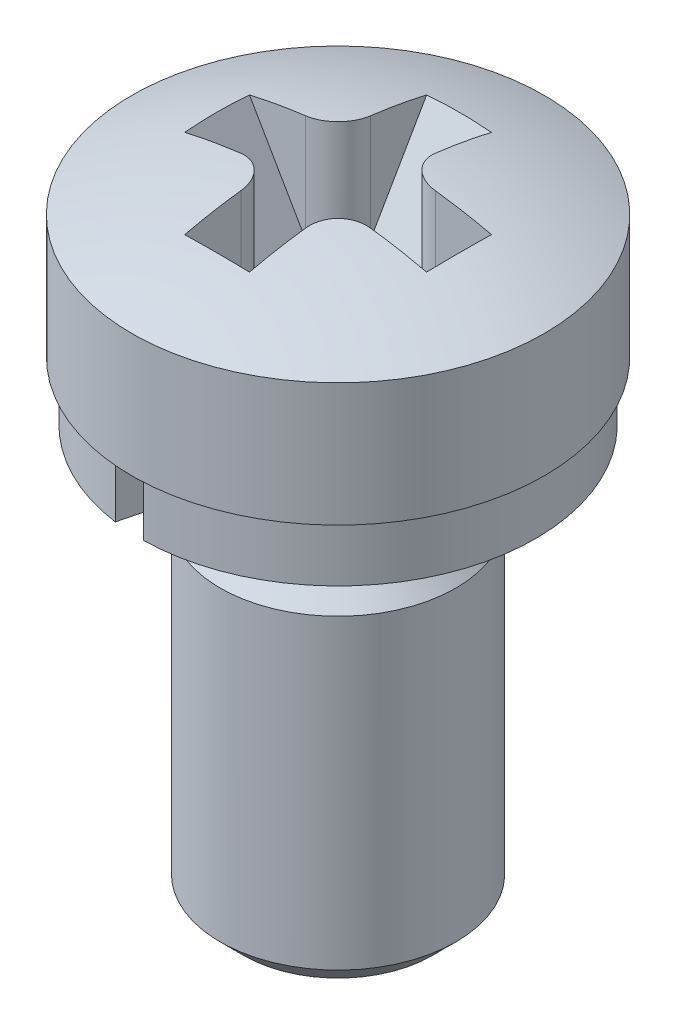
ISO-10303-21;
HEADER;
FILE_DESCRIPTION(('STEP AP214'),'2;1');
FILE_NAME('part.step','',(''),(''),'','','');
FILE_SCHEMA(('AUTOMOTIVE_DESIGN { 1 0 10303 214 1 1 1 1 }'));
ENDSEC;
DATA;
#1=APPLICATION_CONTEXT('core data for automotive mechanical design processes');
#2=APPLICATION_PROTOCOL_DEFINITION('international standard','automotive_design',2000,#1);
#3=PRODUCT_CONTEXT('',#1,'mechanical');
#4=PRODUCT('Part','Part','',(#3));
#5=PRODUCT_RELATED_PRODUCT_CATEGORY('part','',(#4));
#6=PRODUCT_DEFINITION_FORMATION('','',#4);
#7=PRODUCT_DEFINITION_CONTEXT('part definition',#1,'design');
#8=PRODUCT_DEFINITION('design','',#6,#7);
#9=PRODUCT_DEFINITION_SHAPE('','',#8);
#10=(LENGTH_UNIT() NAMED_UNIT(*) SI_UNIT(.MILLI.,.METRE.));
#11=(NAMED_UNIT(*) PLANE_ANGLE_UNIT() SI_UNIT($,.RADIAN.));
#12=(NAMED_UNIT(*) SI_UNIT($,.STERADIAN.) SOLID_ANGLE_UNIT());
#13=UNCERTAINTY_MEASURE_WITH_UNIT(LENGTH_MEASURE(1.E-05),#10,'distance_accuracy_value','');
#14=(GEOMETRIC_REPRESENTATION_CONTEXT(3) GLOBAL_UNCERTAINTY_ASSIGNED_CONTEXT((#13)) GLOBAL_UNIT_ASSIGNED_CONTEXT((#10,
#11,#12)) REPRESENTATION_CONTEXT('',''));
#15=CARTESIAN_POINT('',(0.,0.,0.));
#16=DIRECTION('',(0.,0.,1.));
#17=DIRECTION('',(1.,0.,0.));
#18=AXIS2_PLACEMENT_3D('',#15,#16,#17);
#19=CARTESIAN_POINT('',(0.,-1.01,0.));
#20=DIRECTION('',(0.,1.,0.));
#21=DIRECTION('',(0.,0.,1.));
#22=AXIS2_PLACEMENT_3D('',#19,#20,#21);
#23=PLANE('',#22);
#24=DIRECTION('',(1.,0.,0.));
#25=VECTOR('',#24,1.);
#26=CARTESIAN_POINT('',(0.,-1.01,-0.516876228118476));
#27=LINE('',#26,#25);
#28=CARTESIAN_POINT('',(-0.277002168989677,-1.01,-0.516876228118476));
#29=VERTEX_POINT('',#28);
#30=CARTESIAN_POINT('',(0.277002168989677,-1.01,-0.516876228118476));
#31=VERTEX_POINT('',#30);
#32=EDGE_CURVE('E198',#29,#31,#27,.T.);
#33=ORIENTED_EDGE('',*,*,#32,.F.);
#34=CARTESIAN_POINT('',(-0.55,-1.01,-0.55));
#35=DIRECTION('',(0.,1.,0.));
#36=DIRECTION('',(0.,0.,1.));
#37=AXIS2_PLACEMENT_3D('',#34,#35,#36);
#38=CIRCLE('',#37,0.275);
#39=CARTESIAN_POINT('',(-0.516876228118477,-1.01,-0.277002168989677));
#40=VERTEX_POINT('',#39);
#41=EDGE_CURVE('E290',#40,#29,#38,.T.);
#42=ORIENTED_EDGE('',*,*,#41,.F.);
#43=DIRECTION('',(0.,0.,1.));
#44=VECTOR('',#43,1.);
#45=CARTESIAN_POINT('',(-0.516876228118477,-1.01,0.));
#46=LINE('',#45,#44);
#47=CARTESIAN_POINT('',(-0.516876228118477,-1.01,0.277002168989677));
#48=VERTEX_POINT('',#47);
#49=EDGE_CURVE('E202',#48,#40,#46,.F.);
#50=ORIENTED_EDGE('',*,*,#49,.F.);
#51=CARTESIAN_POINT('',(-0.55,-1.01,0.55));
#52=DIRECTION('',(0.,-1.,0.));
#53=DIRECTION('',(0.,0.,-1.));
#54=AXIS2_PLACEMENT_3D('',#51,#52,#53);
#55=CIRCLE('',#54,0.275);
#56=CARTESIAN_POINT('',(-0.277002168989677,-1.01,0.516876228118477));
#57=VERTEX_POINT('',#56);
#58=EDGE_CURVE('E299',#57,#48,#55,.F.);
#59=ORIENTED_EDGE('',*,*,#58,.F.);
#60=DIRECTION('',(1.,0.,0.));
#61=VECTOR('',#60,1.);
#62=CARTESIAN_POINT('',(0.,-1.01,0.516876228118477));
#63=LINE('',#62,#61);
#64=CARTESIAN_POINT('',(0.277002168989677,-1.01,0.516876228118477));
#65=VERTEX_POINT('',#64);
#66=EDGE_CURVE('E170',#65,#57,#63,.F.);
#67=ORIENTED_EDGE('',*,*,#66,.F.);
#68=CARTESIAN_POINT('',(0.55,-1.01,0.55));
#69=DIRECTION('',(0.,1.,0.));
#70=DIRECTION('',(0.,0.,1.));
#71=AXIS2_PLACEMENT_3D('',#68,#69,#70);
#72=CIRCLE('',#71,0.275);
#73=CARTESIAN_POINT('',(0.516876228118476,-1.01,0.277002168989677));
#74=VERTEX_POINT('',#73);
#75=EDGE_CURVE('E20',#74,#65,#72,.T.);
#76=ORIENTED_EDGE('',*,*,#75,.F.);
#77=DIRECTION('',(0.,0.,1.));
#78=VECTOR('',#77,1.);
#79=CARTESIAN_POINT('',(0.516876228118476,-1.01,0.));
#80=LINE('',#79,#78);
#81=CARTESIAN_POINT('',(0.516876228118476,-1.01,-0.277002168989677));
#82=VERTEX_POINT('',#81);
#83=EDGE_CURVE('E167',#82,#74,#80,.T.);
#84=ORIENTED_EDGE('',*,*,#83,.F.);
#85=CARTESIAN_POINT('',(0.55,-1.01,-0.55));
#86=DIRECTION('',(0.,-1.,0.));
#87=DIRECTION('',(0.,0.,-1.));
#88=AXIS2_PLACEMENT_3D('',#85,#86,#87);
#89=CIRCLE('',#88,0.275);
#90=EDGE_CURVE('E281',#31,#82,#89,.F.);
#91=ORIENTED_EDGE('',*,*,#90,.F.);
#92=EDGE_LOOP('',(#33,#42,#50,#59,#67,#76,#84,#91));
#93=FACE_BOUND('',#92,.T.);
#94=ADVANCED_FACE('F15',(#93),#23,.T.);
#95=CARTESIAN_POINT('',(-1.1,-1.01,0.275));
#96=DIRECTION('',(0.,0.,1.));
#97=DIRECTION('',(1.,0.,0.));
#98=AXIS2_PLACEMENT_3D('',#95,#96,#97);
#99=PLANE('',#98);
#100=CARTESIAN_POINT('',(1.02651265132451,-0.12728382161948,0.275));
#101=CARTESIAN_POINT('',(1.00713660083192,-0.122735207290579,0.274999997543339));
#102=CARTESIAN_POINT('',(0.987730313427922,-0.118315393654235,0.274999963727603));
#103=CARTESIAN_POINT('',(0.948783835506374,-0.109717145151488,0.274999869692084));
#104=CARTESIAN_POINT('',(0.929243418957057,-0.105539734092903,0.274999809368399));
#105=CARTESIAN_POINT('',(0.890031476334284,-0.0974301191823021,0.274999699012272));
#106=CARTESIAN_POINT('',(0.870359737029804,-0.0934989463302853,0.274999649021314));
#107=CARTESIAN_POINT('',(0.830888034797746,-0.0858856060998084,0.274999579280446));
#108=CARTESIAN_POINT('',(0.811087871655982,-0.0822044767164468,0.27499955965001));
#109=CARTESIAN_POINT('',(0.771362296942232,-0.0750950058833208,0.274999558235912));
#110=CARTESIAN_POINT('',(0.751436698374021,-0.0716677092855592,0.274999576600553));
#111=CARTESIAN_POINT('',(0.711463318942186,-0.0650696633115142,0.274999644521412));
#112=CARTESIAN_POINT('',(0.691415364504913,-0.0618999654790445,0.274999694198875));
#113=CARTESIAN_POINT('',(0.651200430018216,-0.0558208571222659,0.274999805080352));
#114=CARTESIAN_POINT('',(0.631033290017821,-0.052912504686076,0.27499986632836));
#115=CARTESIAN_POINT('',(0.59058323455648,-0.0473597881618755,0.2749999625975));
#116=CARTESIAN_POINT('',(0.570300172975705,-0.0447164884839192,0.27499999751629));
#117=CARTESIAN_POINT('',(0.55,-0.042211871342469,0.275));
#118=B_SPLINE_CURVE_WITH_KNOTS('',3,(#100,#101,#102,#103,#104,#105,#106,#107,#108,#109,#110,
#111,#112,#113,#114,#115,#116,#117),.UNSPECIFIED.,.F.,.F.,(4,2,2,2,2,2,2,2,4),(0.,
0.0597079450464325,0.119652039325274,0.179832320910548,0.240248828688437,0.30090160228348,
0.361790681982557,0.422916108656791,0.484277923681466),.UNSPECIFIED.);
#119=CARTESIAN_POINT('',(1.02651265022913,-0.127283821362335,0.275));
#120=VERTEX_POINT('',#119);
#121=CARTESIAN_POINT('',(0.55,-0.0422118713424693,0.275));
#122=VERTEX_POINT('',#121);
#123=EDGE_CURVE('E191',#120,#122,#118,.T.);
#124=ORIENTED_EDGE('',*,*,#123,.F.);
#125=DIRECTION('',(-0.500000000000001,-0.866025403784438,0.));
#126=VECTOR('',#125,1.);
#127=CARTESIAN_POINT('',(1.1,0.,0.275));
#128=LINE('',#127,#126);
#129=CARTESIAN_POINT('',(0.55,-0.952627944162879,0.275));
#130=VERTEX_POINT('',#129);
#131=EDGE_CURVE('E181',#130,#120,#128,.F.);
#132=ORIENTED_EDGE('',*,*,#131,.F.);
#133=DIRECTION('',(0.,1.,0.));
#134=VECTOR('',#133,1.);
#135=CARTESIAN_POINT('',(0.55,-1.01,0.275));
#136=LINE('',#135,#134);
#137=EDGE_CURVE('E174',#122,#130,#136,.F.);
#138=ORIENTED_EDGE('',*,*,#137,.F.);
#139=EDGE_LOOP('',(#124,#132,#138));
#140=FACE_BOUND('',#139,.T.);
#141=ADVANCED_FACE('F272',(#140),#99,.F.);
#142=CARTESIAN_POINT('',(0.55,-1.01,0.55));
#143=DIRECTION('',(0.,1.,0.));
#144=DIRECTION('',(0.,0.,1.));
#145=AXIS2_PLACEMENT_3D('',#142,#143,#144);
#146=CYLINDRICAL_SURFACE('',#145,0.275);
#147=CARTESIAN_POINT('',(0.55,-0.0422118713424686,0.275));
#148=CARTESIAN_POINT('',(0.5346983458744,-0.0403223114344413,0.274986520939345));
#149=CARTESIAN_POINT('',(0.519377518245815,-0.0385923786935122,0.276276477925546));
#150=CARTESIAN_POINT('',(0.489131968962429,-0.0354947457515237,0.281386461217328));
#151=CARTESIAN_POINT('',(0.474207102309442,-0.0341269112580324,0.285205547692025));
#152=CARTESIAN_POINT('',(0.445164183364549,-0.0317940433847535,0.295301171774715));
#153=CARTESIAN_POINT('',(0.431046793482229,-0.0308293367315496,0.301579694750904));
#154=CARTESIAN_POINT('',(0.404047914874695,-0.0293331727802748,0.316419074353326));
#155=CARTESIAN_POINT('',(0.391166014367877,-0.0288015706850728,0.324979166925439));
#156=CARTESIAN_POINT('',(0.367108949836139,-0.0281899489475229,0.344063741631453));
#157=CARTESIAN_POINT('',(0.355920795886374,-0.0281063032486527,0.354571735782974));
#158=CARTESIAN_POINT('',(0.33544627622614,-0.0283833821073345,0.377299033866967));
#159=CARTESIAN_POINT('',(0.326160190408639,-0.0287441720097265,0.389518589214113));
#160=CARTESIAN_POINT('',(0.309782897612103,-0.0298971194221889,0.415267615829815));
#161=CARTESIAN_POINT('',(0.302683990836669,-0.0306877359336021,0.428792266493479));
#162=CARTESIAN_POINT('',(0.290827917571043,-0.03267607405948,0.456802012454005));
#163=CARTESIAN_POINT('',(0.286069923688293,-0.0338736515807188,0.471286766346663));
#164=CARTESIAN_POINT('',(0.280032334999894,-0.0362396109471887,0.49653052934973));
#165=CARTESIAN_POINT('',(0.278144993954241,-0.0373165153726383,0.507157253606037));
#166=CARTESIAN_POINT('',(0.275628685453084,-0.0396404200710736,0.528524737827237));
#167=CARTESIAN_POINT('',(0.274997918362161,-0.0408871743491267,0.539265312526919));
#168=CARTESIAN_POINT('',(0.275,-0.0422118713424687,0.55));
#169=B_SPLINE_CURVE_WITH_KNOTS('',3,(#147,#148,#149,#150,#151,#152,#153,#154,#155,#156,#157,
#158,#159,#160,#161,#162,#163,#164,#165,#166,#167,#168),.UNSPECIFIED.,.F.,.F.,(4,2,2,2,2,2,2,2,
2,2,4),(0.,0.0461983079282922,0.0923794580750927,0.138597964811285,0.184801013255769,
0.230629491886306,0.276464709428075,0.322136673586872,0.367792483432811,0.400261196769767,
0.432683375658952),.UNSPECIFIED.);
#170=CARTESIAN_POINT('',(0.275000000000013,-0.042211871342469,0.55));
#171=VERTEX_POINT('',#170);
#172=EDGE_CURVE('E273',#122,#171,#169,.T.);
#173=ORIENTED_EDGE('',*,*,#172,.F.);
#174=ORIENTED_EDGE('',*,*,#137,.T.);
#175=CARTESIAN_POINT('',(0.55,-0.95262794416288,0.55));
#176=DIRECTION('',(-0.866025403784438,0.500000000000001,0.));
#177=DIRECTION('',(0.500000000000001,0.866025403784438,0.));
#178=AXIS2_PLACEMENT_3D('',#175,#176,#177);
#179=ELLIPSE('',#178,0.549999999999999,0.275);
#180=EDGE_CURVE('E176',#74,#130,#179,.F.);
#181=ORIENTED_EDGE('',*,*,#180,.F.);
#182=ORIENTED_EDGE('',*,*,#75,.T.);
#183=CARTESIAN_POINT('',(0.55,-0.95262794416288,0.55));
#184=DIRECTION('',(0.,0.500000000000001,-0.866025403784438));
#185=DIRECTION('',(0.,0.866025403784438,0.500000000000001));
#186=AXIS2_PLACEMENT_3D('',#183,#184,#185);
#187=ELLIPSE('',#186,0.549999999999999,0.275);
#188=CARTESIAN_POINT('',(0.275000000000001,-0.952627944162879,0.55));
#189=VERTEX_POINT('',#188);
#190=EDGE_CURVE('E208',#189,#65,#187,.F.);
#191=ORIENTED_EDGE('',*,*,#190,.F.);
#192=DIRECTION('',(0.,1.,0.));
#193=VECTOR('',#192,1.);
#194=CARTESIAN_POINT('',(0.275,-1.01,0.55));
#195=LINE('',#194,#193);
#196=EDGE_CURVE('E306',#189,#171,#195,.T.);
#197=ORIENTED_EDGE('',*,*,#196,.T.);
#198=EDGE_LOOP('',(#173,#174,#181,#182,#191,#197));
#199=FACE_BOUND('',#198,.T.);
#200=ADVANCED_FACE('F178',(#199),#146,.T.);
#201=CARTESIAN_POINT('',(0.275,-1.01,1.1));
#202=DIRECTION('',(1.,0.,0.));
#203=DIRECTION('',(0.,0.,-1.));
#204=AXIS2_PLACEMENT_3D('',#201,#202,#203);
#205=PLANE('',#204);
#206=DIRECTION('',(0.,0.866025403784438,0.500000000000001));
#207=VECTOR('',#206,1.);
#208=CARTESIAN_POINT('',(0.275000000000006,0.,1.1));
#209=LINE('',#208,#207);
#210=CARTESIAN_POINT('',(0.275000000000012,-0.127283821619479,1.02651265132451));
#211=VERTEX_POINT('',#210);
#212=EDGE_CURVE('E304',#211,#189,#209,.F.);
#213=ORIENTED_EDGE('',*,*,#212,.F.);
#214=CARTESIAN_POINT('',(0.275000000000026,-4.5,0.));
#215=DIRECTION('',(1.,0.,0.));
#216=DIRECTION('',(0.,1.,0.));
#217=AXIS2_PLACEMENT_3D('',#214,#215,#216);
#218=CIRCLE('',#217,4.49158936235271);
#219=EDGE_CURVE('E279',#171,#211,#218,.T.);
#220=ORIENTED_EDGE('',*,*,#219,.F.);
#221=ORIENTED_EDGE('',*,*,#196,.F.);
#222=EDGE_LOOP('',(#213,#220,#221));
#223=FACE_BOUND('',#222,.T.);
#224=ADVANCED_FACE('F265',(#223),#205,.F.);
#225=CARTESIAN_POINT('',(0.,0.,1.1));
#226=DIRECTION('',(0.,0.500000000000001,-0.866025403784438));
#227=DIRECTION('',(0.,0.866025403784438,0.500000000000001));
#228=AXIS2_PLACEMENT_3D('',#225,#226,#227);
#229=PLANE('',#228);
#230=ORIENTED_EDGE('',*,*,#66,.T.);
#231=CARTESIAN_POINT('',(-0.55,-0.95262794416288,0.55));
#232=DIRECTION('',(0.,0.500000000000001,-0.866025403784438));
#233=DIRECTION('',(0.,-0.866025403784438,-0.500000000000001));
#234=AXIS2_PLACEMENT_3D('',#231,#232,#233);
#235=ELLIPSE('',#234,0.549999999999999,0.275);
#236=CARTESIAN_POINT('',(-0.275,-0.95262794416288,0.55));
#237=VERTEX_POINT('',#236);
#238=EDGE_CURVE('E302',#237,#57,#235,.T.);
#239=ORIENTED_EDGE('',*,*,#238,.F.);
#240=DIRECTION('',(0.,-0.866025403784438,-0.500000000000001));
#241=VECTOR('',#240,1.);
#242=CARTESIAN_POINT('',(-0.275,-0.12728382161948,1.02651265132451));
#243=LINE('',#242,#241);
#244=CARTESIAN_POINT('',(-0.274999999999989,-0.12728382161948,1.02651265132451));
#245=VERTEX_POINT('',#244);
#246=EDGE_CURVE('E207',#245,#237,#243,.T.);
#247=ORIENTED_EDGE('',*,*,#246,.F.);
#248=CARTESIAN_POINT('',(0.,-3.85131397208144,-1.12355715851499));
#249=DIRECTION('',(0.,0.500000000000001,-0.866025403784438));
#250=DIRECTION('',(0.,0.866025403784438,0.500000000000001));
#251=AXIS2_PLACEMENT_3D('',#248,#249,#250);
#252=CIRCLE('',#251,4.30892396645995);
#253=EDGE_CURVE('E564',#211,#245,#252,.F.);
#254=ORIENTED_EDGE('',*,*,#253,.F.);
#255=ORIENTED_EDGE('',*,*,#212,.T.);
#256=ORIENTED_EDGE('',*,*,#190,.T.);
#257=EDGE_LOOP('',(#230,#239,#247,#254,#255,#256));
#258=FACE_BOUND('',#257,.T.);
#259=ADVANCED_FACE('F261',(#258),#229,.T.);
#260=CARTESIAN_POINT('',(-0.275,-1.01,1.1));
#261=DIRECTION('',(1.,0.,0.));
#262=DIRECTION('',(0.,0.,-1.));
#263=AXIS2_PLACEMENT_3D('',#260,#261,#262);
#264=PLANE('',#263);
#265=CARTESIAN_POINT('',(-0.274999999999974,-4.5,0.));
#266=DIRECTION('',(1.,0.,0.));
#267=DIRECTION('',(0.,1.,0.));
#268=AXIS2_PLACEMENT_3D('',#265,#266,#267);
#269=CIRCLE('',#268,4.49158936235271);
#270=CARTESIAN_POINT('',(-0.274999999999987,-0.0422118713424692,0.55));
#271=VERTEX_POINT('',#270);
#272=EDGE_CURVE('E242',#245,#271,#269,.F.);
#273=ORIENTED_EDGE('',*,*,#272,.F.);
#274=ORIENTED_EDGE('',*,*,#246,.T.);
#275=DIRECTION('',(0.,-1.,0.));
#276=VECTOR('',#275,1.);
#277=CARTESIAN_POINT('',(-0.275,-1.01,0.55));
#278=LINE('',#277,#276);
#279=EDGE_CURVE('E301',#271,#237,#278,.T.);
#280=ORIENTED_EDGE('',*,*,#279,.F.);
#281=EDGE_LOOP('',(#273,#274,#280));
#282=FACE_BOUND('',#281,.T.);
#283=ADVANCED_FACE('F256',(#282),#264,.T.);
#284=CARTESIAN_POINT('',(-0.55,-1.01,0.55));
#285=DIRECTION('',(0.,-1.,0.));
#286=DIRECTION('',(0.,0.,-1.));
#287=AXIS2_PLACEMENT_3D('',#284,#285,#286);
#288=CYLINDRICAL_SURFACE('',#287,0.275);
#289=CARTESIAN_POINT('',(-0.275,-0.0422118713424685,0.55));
#290=CARTESIAN_POINT('',(-0.274986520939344,-0.0403223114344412,0.5346983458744));
#291=CARTESIAN_POINT('',(-0.276276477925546,-0.0385923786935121,0.519377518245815));
#292=CARTESIAN_POINT('',(-0.281386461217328,-0.0354947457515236,0.489131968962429));
#293=CARTESIAN_POINT('',(-0.285205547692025,-0.0341269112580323,0.474207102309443));
#294=CARTESIAN_POINT('',(-0.295301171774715,-0.0317940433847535,0.445164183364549));
#295=CARTESIAN_POINT('',(-0.301579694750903,-0.0308293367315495,0.431046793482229));
#296=CARTESIAN_POINT('',(-0.316419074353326,-0.0293331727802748,0.404047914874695));
#297=CARTESIAN_POINT('',(-0.324979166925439,-0.0288015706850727,0.391166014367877));
#298=CARTESIAN_POINT('',(-0.344063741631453,-0.0281899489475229,0.36710894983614));
#299=CARTESIAN_POINT('',(-0.354571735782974,-0.0281063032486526,0.355920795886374));
#300=CARTESIAN_POINT('',(-0.377299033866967,-0.0283833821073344,0.335446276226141));
#301=CARTESIAN_POINT('',(-0.389518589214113,-0.0287441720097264,0.326160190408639));
#302=CARTESIAN_POINT('',(-0.415267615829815,-0.0298971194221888,0.309782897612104));
#303=CARTESIAN_POINT('',(-0.428792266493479,-0.030687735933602,0.30268399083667));
#304=CARTESIAN_POINT('',(-0.456802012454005,-0.03267607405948,0.290827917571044));
#305=CARTESIAN_POINT('',(-0.471286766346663,-0.033873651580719,0.286069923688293));
#306=CARTESIAN_POINT('',(-0.49653052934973,-0.0362396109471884,0.280032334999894));
#307=CARTESIAN_POINT('',(-0.507157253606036,-0.0373165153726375,0.278144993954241));
#308=CARTESIAN_POINT('',(-0.528524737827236,-0.0396404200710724,0.275628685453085));
#309=CARTESIAN_POINT('',(-0.539265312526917,-0.0408871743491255,0.274997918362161));
#310=CARTESIAN_POINT('',(-0.549999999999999,-0.0422118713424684,0.275));
#311=B_SPLINE_CURVE_WITH_KNOTS('',3,(#289,#290,#291,#292,#293,#294,#295,#296,#297,#298,#299,
#300,#301,#302,#303,#304,#305,#306,#307,#308,#309,#310),.UNSPECIFIED.,.F.,.F.,(4,2,2,2,2,2,2,2,
2,2,4),(0.,0.0461983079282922,0.0923794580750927,0.138597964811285,0.184801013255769,
0.230629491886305,0.276464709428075,0.322136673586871,0.367792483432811,0.400261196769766,
0.43268337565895),.UNSPECIFIED.);
#312=CARTESIAN_POINT('',(-0.55,-0.0422118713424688,0.275));
#313=VERTEX_POINT('',#312);
#314=EDGE_CURVE('E234',#271,#313,#311,.T.);
#315=ORIENTED_EDGE('',*,*,#314,.F.);
#316=ORIENTED_EDGE('',*,*,#279,.T.);
#317=ORIENTED_EDGE('',*,*,#238,.T.);
#318=ORIENTED_EDGE('',*,*,#58,.T.);
#319=CARTESIAN_POINT('',(-0.55,-0.95262794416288,0.55));
#320=DIRECTION('',(0.866025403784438,0.500000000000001,0.));
#321=DIRECTION('',(0.500000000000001,-0.866025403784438,0.));
#322=AXIS2_PLACEMENT_3D('',#319,#320,#321);
#323=ELLIPSE('',#322,0.549999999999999,0.275);
#324=CARTESIAN_POINT('',(-0.55,-0.95262794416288,0.275));
#325=VERTEX_POINT('',#324);
#326=EDGE_CURVE('E205',#325,#48,#323,.F.);
#327=ORIENTED_EDGE('',*,*,#326,.F.);
#328=DIRECTION('',(0.,1.,0.));
#329=VECTOR('',#328,1.);
#330=CARTESIAN_POINT('',(-0.55,-1.01,0.275));
#331=LINE('',#330,#329);
#332=EDGE_CURVE('E315',#325,#313,#331,.T.);
#333=ORIENTED_EDGE('',*,*,#332,.T.);
#334=EDGE_LOOP('',(#315,#316,#317,#318,#327,#333));
#335=FACE_BOUND('',#334,.T.);
#336=ADVANCED_FACE('F250',(#335),#288,.T.);
#337=CARTESIAN_POINT('',(-1.1,-1.01,0.275));
#338=DIRECTION('',(0.,0.,1.));
#339=DIRECTION('',(1.,0.,0.));
#340=AXIS2_PLACEMENT_3D('',#337,#338,#339);
#341=PLANE('',#340);
#342=DIRECTION('',(-0.500000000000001,0.866025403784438,0.));
#343=VECTOR('',#342,1.);
#344=CARTESIAN_POINT('',(-1.1,0.,0.275));
#345=LINE('',#344,#343);
#346=CARTESIAN_POINT('',(-1.02651265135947,-0.127283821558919,0.274999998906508));
#347=VERTEX_POINT('',#346);
#348=EDGE_CURVE('E298',#347,#325,#345,.F.);
#349=ORIENTED_EDGE('',*,*,#348,.F.);
#350=CARTESIAN_POINT('',(-0.55,-0.0422118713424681,0.275));
#351=CARTESIAN_POINT('',(-0.570300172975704,-0.0447164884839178,0.27499999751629));
#352=CARTESIAN_POINT('',(-0.590583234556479,-0.0473597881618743,0.2749999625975));
#353=CARTESIAN_POINT('',(-0.63103329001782,-0.0529125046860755,0.27499986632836));
#354=CARTESIAN_POINT('',(-0.651200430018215,-0.0558208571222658,0.274999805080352));
#355=CARTESIAN_POINT('',(-0.691415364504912,-0.0618999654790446,0.274999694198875));
#356=CARTESIAN_POINT('',(-0.711463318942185,-0.0650696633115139,0.274999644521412));
#357=CARTESIAN_POINT('',(-0.75143669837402,-0.0716677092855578,0.274999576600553));
#358=CARTESIAN_POINT('',(-0.771362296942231,-0.0750950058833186,0.274999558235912));
#359=CARTESIAN_POINT('',(-0.81108787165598,-0.0822044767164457,0.27499955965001));
#360=CARTESIAN_POINT('',(-0.830888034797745,-0.085885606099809,0.274999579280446));
#361=CARTESIAN_POINT('',(-0.870359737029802,-0.0934989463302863,0.274999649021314));
#362=CARTESIAN_POINT('',(-0.890031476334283,-0.0974301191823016,0.274999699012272));
#363=CARTESIAN_POINT('',(-0.929243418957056,-0.105539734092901,0.274999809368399));
#364=CARTESIAN_POINT('',(-0.948783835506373,-0.109717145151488,0.274999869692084));
#365=CARTESIAN_POINT('',(-0.987730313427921,-0.118315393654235,0.274999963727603));
#366=CARTESIAN_POINT('',(-1.00713660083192,-0.12273520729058,0.274999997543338));
#367=CARTESIAN_POINT('',(-1.02651265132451,-0.12728382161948,0.275));
#368=B_SPLINE_CURVE_WITH_KNOTS('',3,(#350,#351,#352,#353,#354,#355,#356,#357,#358,#359,#360,
#361,#362,#363,#364,#365,#366,#367),.UNSPECIFIED.,.F.,.F.,(4,2,2,2,2,2,2,2,4),(0.,
0.061361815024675,0.122487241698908,0.183376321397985,0.244029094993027,0.304445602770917,
0.364625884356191,0.424569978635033,0.484277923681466),.UNSPECIFIED.);
#369=EDGE_CURVE('E212',#313,#347,#368,.T.);
#370=ORIENTED_EDGE('',*,*,#369,.F.);
#371=ORIENTED_EDGE('',*,*,#332,.F.);
#372=EDGE_LOOP('',(#349,#370,#371));
#373=FACE_BOUND('',#372,.T.);
#374=ADVANCED_FACE('F255',(#373),#341,.F.);
#375=CARTESIAN_POINT('',(-1.1,0.,0.));
#376=DIRECTION('',(0.866025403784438,0.500000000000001,0.));
#377=DIRECTION('',(-0.500000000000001,0.866025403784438,0.));
#378=AXIS2_PLACEMENT_3D('',#375,#376,#377);
#379=PLANE('',#378);
#380=CARTESIAN_POINT('',(-0.55,-0.95262794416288,-0.55));
#381=DIRECTION('',(0.866025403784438,0.500000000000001,0.));
#382=DIRECTION('',(-0.500000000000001,0.866025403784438,0.));
#383=AXIS2_PLACEMENT_3D('',#380,#381,#382);
#384=ELLIPSE('',#383,0.549999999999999,0.275);
#385=CARTESIAN_POINT('',(-0.55,-0.95262794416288,-0.275));
#386=VERTEX_POINT('',#385);
#387=EDGE_CURVE('E293',#386,#40,#384,.T.);
#388=ORIENTED_EDGE('',*,*,#387,.F.);
#389=DIRECTION('',(0.500000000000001,-0.866025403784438,0.));
#390=VECTOR('',#389,1.);
#391=CARTESIAN_POINT('',(-1.02651265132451,-0.127283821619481,-0.275));
#392=LINE('',#391,#390);
#393=CARTESIAN_POINT('',(-1.02651265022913,-0.127283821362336,-0.275));
#394=VERTEX_POINT('',#393);
#395=EDGE_CURVE('E204',#394,#386,#392,.T.);
#396=ORIENTED_EDGE('',*,*,#395,.F.);
#397=CARTESIAN_POINT('',(-1.03090482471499,-0.119676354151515,0.));
#398=CARTESIAN_POINT('',(-1.03090482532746,-0.119676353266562,-0.0114637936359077));
#399=CARTESIAN_POINT('',(-1.03088195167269,-0.119715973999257,-0.022927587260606));
#400=CARTESIAN_POINT('',(-1.03079045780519,-0.11987445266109,-0.0458545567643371));
#401=CARTESIAN_POINT('',(-1.03072183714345,-0.119993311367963,-0.0573177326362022));
#402=CARTESIAN_POINT('',(-1.03053884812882,-0.120310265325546,-0.0802430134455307));
#403=CARTESIAN_POINT('',(-1.03042447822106,-0.120508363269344,-0.0917051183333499));
#404=CARTESIAN_POINT('',(-1.0301499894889,-0.120983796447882,-0.114627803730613));
#405=CARTESIAN_POINT('',(-1.02998986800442,-0.121261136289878,-0.126088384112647));
#406=CARTESIAN_POINT('',(-1.02962387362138,-0.121895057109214,-0.149007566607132));
#407=CARTESIAN_POINT('',(-1.02941799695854,-0.122251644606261,-0.160466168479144));
#408=CARTESIAN_POINT('',(-1.02896048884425,-0.123044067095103,-0.183380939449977));
#409=CARTESIAN_POINT('',(-1.02870885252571,-0.123479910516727,-0.194837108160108));
#410=CARTESIAN_POINT('',(-1.02815982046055,-0.12443085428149,-0.21774655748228));
#411=CARTESIAN_POINT('',(-1.02786241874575,-0.124945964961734,-0.22919983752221));
#412=CARTESIAN_POINT('',(-1.02722185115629,-0.126055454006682,-0.252103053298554));
#413=CARTESIAN_POINT('',(-1.02687867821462,-0.126649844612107,-0.263552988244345));
#414=CARTESIAN_POINT('',(-1.02651265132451,-0.127283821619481,-0.274999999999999));
#415=B_SPLINE_CURVE_WITH_KNOTS('',3,(#397,#398,#399,#400,#401,#402,#403,#404,#405,#406,#407,
#408,#409,#410,#411,#412,#413,#414),.UNSPECIFIED.,.F.,.F.,(4,2,2,2,2,2,2,2,4),(0.,
0.0343912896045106,0.0687829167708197,0.103175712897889,0.137570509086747,0.171968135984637,
0.206369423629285,0.240775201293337,0.275186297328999),.UNSPECIFIED.);
#416=CARTESIAN_POINT('',(-1.03090482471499,-0.119676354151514,0.));
#417=VERTEX_POINT('',#416);
#418=EDGE_CURVE('E211',#417,#394,#415,.T.);
#419=ORIENTED_EDGE('',*,*,#418,.F.);
#420=CARTESIAN_POINT('',(-1.02651265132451,-0.12728382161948,0.275));
#421=CARTESIAN_POINT('',(-1.02687867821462,-0.126649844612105,0.263552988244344));
#422=CARTESIAN_POINT('',(-1.02722185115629,-0.12605545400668,0.252103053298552));
#423=CARTESIAN_POINT('',(-1.02786241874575,-0.124945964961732,0.229199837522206));
#424=CARTESIAN_POINT('',(-1.02815982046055,-0.124430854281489,0.217746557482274));
#425=CARTESIAN_POINT('',(-1.02870885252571,-0.123479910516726,0.194837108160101));
#426=CARTESIAN_POINT('',(-1.02896048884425,-0.123044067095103,0.183380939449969));
#427=CARTESIAN_POINT('',(-1.02941799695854,-0.12225164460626,0.160466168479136));
#428=CARTESIAN_POINT('',(-1.02962387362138,-0.121895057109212,0.149007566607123));
#429=CARTESIAN_POINT('',(-1.02998986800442,-0.121261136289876,0.126088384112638));
#430=CARTESIAN_POINT('',(-1.0301499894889,-0.12098379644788,0.114627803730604));
#431=CARTESIAN_POINT('',(-1.03042447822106,-0.120508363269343,0.0917051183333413));
#432=CARTESIAN_POINT('',(-1.03053884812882,-0.120310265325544,0.0802430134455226));
#433=CARTESIAN_POINT('',(-1.03072183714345,-0.119993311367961,0.0573177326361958));
#434=CARTESIAN_POINT('',(-1.03079045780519,-0.119874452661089,0.0458545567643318));
#435=CARTESIAN_POINT('',(-1.03088195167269,-0.119715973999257,0.022927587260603));
#436=CARTESIAN_POINT('',(-1.03090482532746,-0.119676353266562,0.011463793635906));
#437=CARTESIAN_POINT('',(-1.03090482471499,-0.119676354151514,0.));
#438=B_SPLINE_CURVE_WITH_KNOTS('',3,(#420,#421,#422,#423,#424,#425,#426,#427,#428,#429,#430,
#431,#432,#433,#434,#435,#436,#437),.UNSPECIFIED.,.F.,.F.,(4,2,2,2,2,2,2,2,4),(0.,
0.0344110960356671,0.0688168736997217,0.103218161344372,0.137615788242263,0.172010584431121,
0.206403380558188,0.240795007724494,0.275186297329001),.UNSPECIFIED.);
#439=EDGE_CURVE('E209',#347,#417,#438,.T.);
#440=ORIENTED_EDGE('',*,*,#439,.F.);
#441=ORIENTED_EDGE('',*,*,#348,.T.);
#442=ORIENTED_EDGE('',*,*,#326,.T.);
#443=ORIENTED_EDGE('',*,*,#49,.T.);
#444=EDGE_LOOP('',(#388,#396,#419,#440,#441,#442,#443));
#445=FACE_BOUND('',#444,.T.);
#446=ADVANCED_FACE('F423',(#445),#379,.T.);
#447=CARTESIAN_POINT('',(-1.1,-1.01,-0.275));
#448=DIRECTION('',(0.,0.,1.));
#449=DIRECTION('',(1.,0.,0.));
#450=AXIS2_PLACEMENT_3D('',#447,#448,#449);
#451=PLANE('',#450);
#452=CARTESIAN_POINT('',(-1.02651265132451,-0.127283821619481,-0.275));
#453=CARTESIAN_POINT('',(-1.00713660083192,-0.122735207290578,-0.274999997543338));
#454=CARTESIAN_POINT('',(-0.987730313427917,-0.118315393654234,-0.274999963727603));
#455=CARTESIAN_POINT('',(-0.948783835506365,-0.109717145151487,-0.274999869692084));
#456=CARTESIAN_POINT('',(-0.929243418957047,-0.105539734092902,-0.274999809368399));
#457=CARTESIAN_POINT('',(-0.890031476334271,-0.0974301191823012,-0.274999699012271));
#458=CARTESIAN_POINT('',(-0.870359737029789,-0.0934989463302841,-0.274999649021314));
#459=CARTESIAN_POINT('',(-0.83088803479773,-0.0858856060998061,-0.274999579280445));
#460=CARTESIAN_POINT('',(-0.811087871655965,-0.0822044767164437,-0.27499955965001));
#461=CARTESIAN_POINT('',(-0.771362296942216,-0.0750950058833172,-0.274999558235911));
#462=CARTESIAN_POINT('',(-0.751436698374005,-0.0716677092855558,-0.274999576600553));
#463=CARTESIAN_POINT('',(-0.711463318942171,-0.0650696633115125,-0.274999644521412));
#464=CARTESIAN_POINT('',(-0.6914153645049,-0.0618999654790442,-0.274999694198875));
#465=CARTESIAN_POINT('',(-0.651200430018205,-0.0558208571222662,-0.274999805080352));
#466=CARTESIAN_POINT('',(-0.631033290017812,-0.0529125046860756,-0.274999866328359));
#467=CARTESIAN_POINT('',(-0.590583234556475,-0.0473597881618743,-0.2749999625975));
#468=CARTESIAN_POINT('',(-0.570300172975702,-0.0447164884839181,-0.27499999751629));
#469=CARTESIAN_POINT('',(-0.55,-0.0422118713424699,-0.275));
#470=B_SPLINE_CURVE_WITH_KNOTS('',3,(#452,#453,#454,#455,#456,#457,#458,#459,#460,#461,#462,
#463,#464,#465,#466,#467,#468,#469),.UNSPECIFIED.,.F.,.F.,(4,2,2,2,2,2,2,2,4),(0.,
0.0597079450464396,0.119652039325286,0.179832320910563,0.240248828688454,0.300901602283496,
0.361790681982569,0.422916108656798,0.484277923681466),.UNSPECIFIED.);
#471=CARTESIAN_POINT('',(-0.55,-0.0422118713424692,-0.275));
#472=VERTEX_POINT('',#471);
#473=EDGE_CURVE('E518',#394,#472,#470,.T.);
#474=ORIENTED_EDGE('',*,*,#473,.F.);
#475=ORIENTED_EDGE('',*,*,#395,.T.);
#476=DIRECTION('',(0.,1.,0.));
#477=VECTOR('',#476,1.);
#478=CARTESIAN_POINT('',(-0.55,-1.01,-0.275));
#479=LINE('',#478,#477);
#480=EDGE_CURVE('E292',#472,#386,#479,.F.);
#481=ORIENTED_EDGE('',*,*,#480,.F.);
#482=EDGE_LOOP('',(#474,#475,#481));
#483=FACE_BOUND('',#482,.T.);
#484=ADVANCED_FACE('F420',(#483),#451,.T.);
#485=CARTESIAN_POINT('',(-0.55,-1.01,-0.55));
#486=DIRECTION('',(0.,1.,0.));
#487=DIRECTION('',(0.,0.,1.));
#488=AXIS2_PLACEMENT_3D('',#485,#486,#487);
#489=CYLINDRICAL_SURFACE('',#488,0.275);
#490=CARTESIAN_POINT('',(-0.55,-0.0422118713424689,-0.275));
#491=CARTESIAN_POINT('',(-0.5346983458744,-0.0403223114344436,-0.274986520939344));
#492=CARTESIAN_POINT('',(-0.519377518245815,-0.0385923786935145,-0.276276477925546));
#493=CARTESIAN_POINT('',(-0.489131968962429,-0.0354947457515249,-0.281386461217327));
#494=CARTESIAN_POINT('',(-0.474207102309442,-0.0341269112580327,-0.285205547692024));
#495=CARTESIAN_POINT('',(-0.445164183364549,-0.0317940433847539,-0.295301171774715));
#496=CARTESIAN_POINT('',(-0.431046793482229,-0.0308293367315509,-0.301579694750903));
#497=CARTESIAN_POINT('',(-0.404047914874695,-0.0293331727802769,-0.316419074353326));
#498=CARTESIAN_POINT('',(-0.391166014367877,-0.0288015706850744,-0.324979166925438));
#499=CARTESIAN_POINT('',(-0.36710894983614,-0.0281899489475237,-0.344063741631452));
#500=CARTESIAN_POINT('',(-0.355920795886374,-0.0281063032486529,-0.354571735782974));
#501=CARTESIAN_POINT('',(-0.335446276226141,-0.028383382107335,-0.377299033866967));
#502=CARTESIAN_POINT('',(-0.326160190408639,-0.0287441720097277,-0.389518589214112));
#503=CARTESIAN_POINT('',(-0.309782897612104,-0.0298971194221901,-0.415267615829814));
#504=CARTESIAN_POINT('',(-0.30268399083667,-0.0306877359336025,-0.428792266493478));
#505=CARTESIAN_POINT('',(-0.290827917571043,-0.0326760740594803,-0.456802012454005));
#506=CARTESIAN_POINT('',(-0.286069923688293,-0.0338736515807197,-0.471286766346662));
#507=CARTESIAN_POINT('',(-0.280032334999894,-0.0362396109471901,-0.49653052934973));
#508=CARTESIAN_POINT('',(-0.278144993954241,-0.0373165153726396,-0.507157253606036));
#509=CARTESIAN_POINT('',(-0.275628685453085,-0.0396404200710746,-0.528524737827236));
#510=CARTESIAN_POINT('',(-0.274997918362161,-0.0408871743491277,-0.539265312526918));
#511=CARTESIAN_POINT('',(-0.275,-0.0422118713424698,-0.55));
#512=B_SPLINE_CURVE_WITH_KNOTS('',3,(#490,#491,#492,#493,#494,#495,#496,#497,#498,#499,#500,
#501,#502,#503,#504,#505,#506,#507,#508,#509,#510,#511),.UNSPECIFIED.,.F.,.F.,(4,2,2,2,2,2,2,2,
2,2,4),(0.,0.0461983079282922,0.0923794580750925,0.138597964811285,0.184801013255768,
0.230629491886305,0.276464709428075,0.322136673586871,0.367792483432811,0.400261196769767,
0.432683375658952),.UNSPECIFIED.);
#513=CARTESIAN_POINT('',(-0.274999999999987,-0.0422118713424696,-0.55));
#514=VERTEX_POINT('',#513);
#515=EDGE_CURVE('E243',#472,#514,#512,.T.);
#516=ORIENTED_EDGE('',*,*,#515,.F.);
#517=ORIENTED_EDGE('',*,*,#480,.T.);
#518=ORIENTED_EDGE('',*,*,#387,.T.);
#519=ORIENTED_EDGE('',*,*,#41,.T.);
#520=CARTESIAN_POINT('',(-0.55,-0.95262794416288,-0.55));
#521=DIRECTION('',(0.,0.500000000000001,0.866025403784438));
#522=DIRECTION('',(0.,0.866025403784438,-0.500000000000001));
#523=AXIS2_PLACEMENT_3D('',#520,#521,#522);
#524=ELLIPSE('',#523,0.549999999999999,0.275);
#525=CARTESIAN_POINT('',(-0.274999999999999,-0.95262794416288,-0.55));
#526=VERTEX_POINT('',#525);
#527=EDGE_CURVE('E201',#526,#29,#524,.F.);
#528=ORIENTED_EDGE('',*,*,#527,.F.);
#529=DIRECTION('',(0.,1.,0.));
#530=VECTOR('',#529,1.);
#531=CARTESIAN_POINT('',(-0.275,-1.01,-0.55));
#532=LINE('',#531,#530);
#533=EDGE_CURVE('E323',#514,#526,#532,.F.);
#534=ORIENTED_EDGE('',*,*,#533,.F.);
#535=EDGE_LOOP('',(#516,#517,#518,#519,#528,#534));
#536=FACE_BOUND('',#535,.T.);
#537=ADVANCED_FACE('F415',(#536),#489,.T.);
#538=CARTESIAN_POINT('',(-0.275,-1.01,1.1));
#539=DIRECTION('',(1.,0.,0.));
#540=DIRECTION('',(0.,0.,-1.));
#541=AXIS2_PLACEMENT_3D('',#538,#539,#540);
#542=PLANE('',#541);
#543=DIRECTION('',(0.,-0.866025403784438,0.500000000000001));
#544=VECTOR('',#543,1.);
#545=CARTESIAN_POINT('',(-0.274999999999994,0.,-1.1));
#546=LINE('',#545,#544);
#547=CARTESIAN_POINT('',(-0.274999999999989,-0.127283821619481,-1.02651265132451));
#548=VERTEX_POINT('',#547);
#549=EDGE_CURVE('E289',#548,#526,#546,.T.);
#550=ORIENTED_EDGE('',*,*,#549,.F.);
#551=CARTESIAN_POINT('',(-0.274999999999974,-4.5,0.));
#552=DIRECTION('',(1.,0.,0.));
#553=DIRECTION('',(0.,1.,0.));
#554=AXIS2_PLACEMENT_3D('',#551,#552,#553);
#555=CIRCLE('',#554,4.49158936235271);
#556=EDGE_CURVE('E543',#514,#548,#555,.F.);
#557=ORIENTED_EDGE('',*,*,#556,.F.);
#558=ORIENTED_EDGE('',*,*,#533,.T.);
#559=EDGE_LOOP('',(#550,#557,#558));
#560=FACE_BOUND('',#559,.T.);
#561=ADVANCED_FACE('F412',(#560),#542,.T.);
#562=CARTESIAN_POINT('',(0.,0.,-1.1));
#563=DIRECTION('',(0.,0.500000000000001,0.866025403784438));
#564=DIRECTION('',(0.,-0.866025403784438,0.500000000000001));
#565=AXIS2_PLACEMENT_3D('',#562,#563,#564);
#566=PLANE('',#565);
#567=ORIENTED_EDGE('',*,*,#527,.T.);
#568=ORIENTED_EDGE('',*,*,#32,.T.);
#569=CARTESIAN_POINT('',(0.55,-0.95262794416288,-0.55));
#570=DIRECTION('',(0.,0.500000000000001,0.866025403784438));
#571=DIRECTION('',(0.,-0.866025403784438,0.500000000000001));
#572=AXIS2_PLACEMENT_3D('',#569,#570,#571);
#573=ELLIPSE('',#572,0.549999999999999,0.275);
#574=CARTESIAN_POINT('',(0.275,-0.95262794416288,-0.55));
#575=VERTEX_POINT('',#574);
#576=EDGE_CURVE('E284',#575,#31,#573,.T.);
#577=ORIENTED_EDGE('',*,*,#576,.F.);
#578=DIRECTION('',(0.,0.866025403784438,-0.500000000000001));
#579=VECTOR('',#578,1.);
#580=CARTESIAN_POINT('',(0.275,-0.95262794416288,-0.55));
#581=LINE('',#580,#579);
#582=CARTESIAN_POINT('',(0.275000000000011,-0.127283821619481,-1.02651265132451));
#583=VERTEX_POINT('',#582);
#584=EDGE_CURVE('E200',#575,#583,#581,.T.);
#585=ORIENTED_EDGE('',*,*,#584,.T.);
#586=CARTESIAN_POINT('',(0.,-3.85131397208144,1.12355715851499));
#587=DIRECTION('',(0.,0.500000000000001,0.866025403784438));
#588=DIRECTION('',(0.,-0.866025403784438,0.500000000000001));
#589=AXIS2_PLACEMENT_3D('',#586,#587,#588);
#590=CIRCLE('',#589,4.30892396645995);
#591=EDGE_CURVE('E546',#548,#583,#590,.F.);
#592=ORIENTED_EDGE('',*,*,#591,.F.);
#593=ORIENTED_EDGE('',*,*,#549,.T.);
#594=EDGE_LOOP('',(#567,#568,#577,#585,#592,#593));
#595=FACE_BOUND('',#594,.T.);
#596=ADVANCED_FACE('F408',(#595),#566,.T.);
#597=CARTESIAN_POINT('',(0.275,-1.01,1.1));
#598=DIRECTION('',(1.,0.,0.));
#599=DIRECTION('',(0.,0.,-1.));
#600=AXIS2_PLACEMENT_3D('',#597,#598,#599);
#601=PLANE('',#600);
#602=CARTESIAN_POINT('',(0.275000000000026,-4.5,0.));
#603=DIRECTION('',(1.,0.,0.));
#604=DIRECTION('',(0.,1.,0.));
#605=AXIS2_PLACEMENT_3D('',#602,#603,#604);
#606=CIRCLE('',#605,4.49158936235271);
#607=CARTESIAN_POINT('',(0.275000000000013,-0.0422118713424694,-0.55));
#608=VERTEX_POINT('',#607);
#609=EDGE_CURVE('E395',#583,#608,#606,.T.);
#610=ORIENTED_EDGE('',*,*,#609,.F.);
#611=ORIENTED_EDGE('',*,*,#584,.F.);
#612=DIRECTION('',(0.,-1.,0.));
#613=VECTOR('',#612,1.);
#614=CARTESIAN_POINT('',(0.275,-1.01,-0.55));
#615=LINE('',#614,#613);
#616=EDGE_CURVE('E283',#608,#575,#615,.T.);
#617=ORIENTED_EDGE('',*,*,#616,.F.);
#618=EDGE_LOOP('',(#610,#611,#617));
#619=FACE_BOUND('',#618,.T.);
#620=ADVANCED_FACE('F403',(#619),#601,.F.);
#621=CARTESIAN_POINT('',(0.55,-1.01,-0.55));
#622=DIRECTION('',(0.,-1.,0.));
#623=DIRECTION('',(0.,0.,-1.));
#624=AXIS2_PLACEMENT_3D('',#621,#622,#623);
#625=CYLINDRICAL_SURFACE('',#624,0.275);
#626=CARTESIAN_POINT('',(0.275,-0.0422118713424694,-0.549999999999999));
#627=CARTESIAN_POINT('',(0.274986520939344,-0.0403223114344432,-0.534698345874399));
#628=CARTESIAN_POINT('',(0.276276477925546,-0.0385923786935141,-0.519377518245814));
#629=CARTESIAN_POINT('',(0.281386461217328,-0.035494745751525,-0.489131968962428));
#630=CARTESIAN_POINT('',(0.285205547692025,-0.0341269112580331,-0.474207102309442));
#631=CARTESIAN_POINT('',(0.295301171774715,-0.0317940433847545,-0.445164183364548));
#632=CARTESIAN_POINT('',(0.301579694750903,-0.0308293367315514,-0.431046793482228));
#633=CARTESIAN_POINT('',(0.316419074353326,-0.0293331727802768,-0.404047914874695));
#634=CARTESIAN_POINT('',(0.324979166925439,-0.028801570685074,-0.391166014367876));
#635=CARTESIAN_POINT('',(0.344063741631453,-0.0281899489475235,-0.367108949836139));
#636=CARTESIAN_POINT('',(0.354571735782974,-0.0281063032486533,-0.355920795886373));
#637=CARTESIAN_POINT('',(0.377299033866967,-0.0283833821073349,-0.33544627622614));
#638=CARTESIAN_POINT('',(0.389518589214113,-0.0287441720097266,-0.326160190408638));
#639=CARTESIAN_POINT('',(0.415267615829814,-0.0298971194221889,-0.309782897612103));
#640=CARTESIAN_POINT('',(0.428792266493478,-0.0306877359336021,-0.302683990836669));
#641=CARTESIAN_POINT('',(0.456802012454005,-0.0326760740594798,-0.290827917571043));
#642=CARTESIAN_POINT('',(0.471286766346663,-0.0338736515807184,-0.286069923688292));
#643=CARTESIAN_POINT('',(0.49653052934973,-0.0362396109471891,-0.280032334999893));
#644=CARTESIAN_POINT('',(0.507157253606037,-0.0373165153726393,-0.27814499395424));
#645=CARTESIAN_POINT('',(0.528524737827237,-0.0396404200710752,-0.275628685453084));
#646=CARTESIAN_POINT('',(0.539265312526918,-0.0408871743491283,-0.274997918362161));
#647=CARTESIAN_POINT('',(0.55,-0.0422118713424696,-0.275));
#648=B_SPLINE_CURVE_WITH_KNOTS('',3,(#626,#627,#628,#629,#630,#631,#632,#633,#634,#635,#636,
#637,#638,#639,#640,#641,#642,#643,#644,#645,#646,#647),.UNSPECIFIED.,.F.,.F.,(4,2,2,2,2,2,2,2,
2,2,4),(0.,0.0461983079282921,0.0923794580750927,0.138597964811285,0.184801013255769,
0.230629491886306,0.276464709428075,0.322136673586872,0.367792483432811,0.400261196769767,
0.432683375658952),.UNSPECIFIED.);
#649=CARTESIAN_POINT('',(0.55,-0.0422118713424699,-0.275));
#650=VERTEX_POINT('',#649);
#651=EDGE_CURVE('E387',#608,#650,#648,.T.);
#652=ORIENTED_EDGE('',*,*,#651,.F.);
#653=ORIENTED_EDGE('',*,*,#616,.T.);
#654=ORIENTED_EDGE('',*,*,#576,.T.);
#655=ORIENTED_EDGE('',*,*,#90,.T.);
#656=CARTESIAN_POINT('',(0.55,-0.95262794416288,-0.55));
#657=DIRECTION('',(-0.866025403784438,0.500000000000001,0.));
#658=DIRECTION('',(-0.500000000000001,-0.866025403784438,0.));
#659=AXIS2_PLACEMENT_3D('',#656,#657,#658);
#660=ELLIPSE('',#659,0.549999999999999,0.275);
#661=CARTESIAN_POINT('',(0.55,-0.952627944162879,-0.275));
#662=VERTEX_POINT('',#661);
#663=EDGE_CURVE('E187',#662,#82,#660,.F.);
#664=ORIENTED_EDGE('',*,*,#663,.F.);
#665=DIRECTION('',(0.,1.,0.));
#666=VECTOR('',#665,1.);
#667=CARTESIAN_POINT('',(0.55,-1.01,-0.275));
#668=LINE('',#667,#666);
#669=EDGE_CURVE('E182',#650,#662,#668,.F.);
#670=ORIENTED_EDGE('',*,*,#669,.F.);
#671=EDGE_LOOP('',(#652,#653,#654,#655,#664,#670));
#672=FACE_BOUND('',#671,.T.);
#673=ADVANCED_FACE('F397',(#672),#625,.T.);
#674=CARTESIAN_POINT('',(-1.1,-1.01,-0.275));
#675=DIRECTION('',(0.,0.,1.));
#676=DIRECTION('',(1.,0.,0.));
#677=AXIS2_PLACEMENT_3D('',#674,#675,#676);
#678=PLANE('',#677);
#679=DIRECTION('',(-0.500000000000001,-0.866025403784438,0.));
#680=VECTOR('',#679,1.);
#681=CARTESIAN_POINT('',(1.1,0.,-0.275));
#682=LINE('',#681,#680);
#683=CARTESIAN_POINT('',(1.02651265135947,-0.127283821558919,-0.274999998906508));
#684=VERTEX_POINT('',#683);
#685=EDGE_CURVE('E193',#684,#662,#682,.T.);
#686=ORIENTED_EDGE('',*,*,#685,.F.);
#687=CARTESIAN_POINT('',(0.55,-0.042211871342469,-0.275));
#688=CARTESIAN_POINT('',(0.570300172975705,-0.0447164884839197,-0.27499999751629));
#689=CARTESIAN_POINT('',(0.590583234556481,-0.0473597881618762,-0.274999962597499));
#690=CARTESIAN_POINT('',(0.631033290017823,-0.052912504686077,-0.274999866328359));
#691=CARTESIAN_POINT('',(0.651200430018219,-0.0558208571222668,-0.274999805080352));
#692=CARTESIAN_POINT('',(0.691415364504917,-0.0618999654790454,-0.274999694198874));
#693=CARTESIAN_POINT('',(0.71146331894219,-0.0650696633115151,-0.274999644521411));
#694=CARTESIAN_POINT('',(0.751436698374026,-0.07166770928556,-0.274999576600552));
#695=CARTESIAN_POINT('',(0.771362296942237,-0.0750950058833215,-0.274999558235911));
#696=CARTESIAN_POINT('',(0.811087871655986,-0.0822044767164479,-0.27499955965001));
#697=CARTESIAN_POINT('',(0.830888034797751,-0.0858856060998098,-0.274999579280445));
#698=CARTESIAN_POINT('',(0.870359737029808,-0.0934989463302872,-0.274999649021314));
#699=CARTESIAN_POINT('',(0.890031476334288,-0.097430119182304,-0.274999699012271));
#700=CARTESIAN_POINT('',(0.92924341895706,-0.105539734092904,-0.274999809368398));
#701=CARTESIAN_POINT('',(0.948783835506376,-0.109717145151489,-0.274999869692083));
#702=CARTESIAN_POINT('',(0.987730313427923,-0.118315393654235,-0.274999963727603));
#703=CARTESIAN_POINT('',(1.00713660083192,-0.122735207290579,-0.274999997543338));
#704=CARTESIAN_POINT('',(1.02651265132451,-0.127283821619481,-0.275));
#705=B_SPLINE_CURVE_WITH_KNOTS('',3,(#687,#688,#689,#690,#691,#692,#693,#694,#695,#696,#697,
#698,#699,#700,#701,#702,#703,#704),.UNSPECIFIED.,.F.,.F.,(4,2,2,2,2,2,2,2,4),(0.,
0.0613618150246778,0.122487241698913,0.183376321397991,0.244029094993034,0.304445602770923,
0.364625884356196,0.424569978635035,0.484277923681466),.UNSPECIFIED.);
#706=EDGE_CURVE('E394',#650,#684,#705,.T.);
#707=ORIENTED_EDGE('',*,*,#706,.F.);
#708=ORIENTED_EDGE('',*,*,#669,.T.);
#709=EDGE_LOOP('',(#686,#707,#708));
#710=FACE_BOUND('',#709,.T.);
#711=ADVANCED_FACE('F402',(#710),#678,.T.);
#712=CARTESIAN_POINT('',(1.1,0.,0.));
#713=DIRECTION('',(-0.866025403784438,0.500000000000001,0.));
#714=DIRECTION('',(-0.500000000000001,-0.866025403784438,0.));
#715=AXIS2_PLACEMENT_3D('',#712,#713,#714);
#716=PLANE('',#715);
#717=ORIENTED_EDGE('',*,*,#663,.T.);
#718=ORIENTED_EDGE('',*,*,#83,.T.);
#719=ORIENTED_EDGE('',*,*,#180,.T.);
#720=ORIENTED_EDGE('',*,*,#131,.T.);
#721=CARTESIAN_POINT('',(1.03090482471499,-0.119676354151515,0.));
#722=CARTESIAN_POINT('',(1.03090482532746,-0.119676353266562,0.0114637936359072));
#723=CARTESIAN_POINT('',(1.03088195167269,-0.119715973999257,0.0229275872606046));
#724=CARTESIAN_POINT('',(1.03079045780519,-0.119874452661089,0.045854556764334));
#725=CARTESIAN_POINT('',(1.03072183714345,-0.119993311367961,0.0573177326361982));
#726=CARTESIAN_POINT('',(1.03053884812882,-0.120310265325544,0.0802430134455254));
#727=CARTESIAN_POINT('',(1.03042447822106,-0.120508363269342,0.0917051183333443));
#728=CARTESIAN_POINT('',(1.0301499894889,-0.120983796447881,0.114627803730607));
#729=CARTESIAN_POINT('',(1.02998986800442,-0.121261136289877,0.126088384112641));
#730=CARTESIAN_POINT('',(1.02962387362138,-0.121895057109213,0.149007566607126));
#731=CARTESIAN_POINT('',(1.02941799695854,-0.122251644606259,0.160466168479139));
#732=CARTESIAN_POINT('',(1.02896048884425,-0.123044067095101,0.183380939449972));
#733=CARTESIAN_POINT('',(1.02870885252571,-0.123479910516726,0.194837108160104));
#734=CARTESIAN_POINT('',(1.02815982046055,-0.124430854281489,0.217746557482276));
#735=CARTESIAN_POINT('',(1.02786241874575,-0.124945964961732,0.229199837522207));
#736=CARTESIAN_POINT('',(1.02722185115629,-0.12605545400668,0.252103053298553));
#737=CARTESIAN_POINT('',(1.02687867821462,-0.126649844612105,0.263552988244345));
#738=CARTESIAN_POINT('',(1.02651265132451,-0.12728382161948,0.275));
#739=B_SPLINE_CURVE_WITH_KNOTS('',3,(#721,#722,#723,#724,#725,#726,#727,#728,#729,#730,#731,
#732,#733,#734,#735,#736,#737,#738),.UNSPECIFIED.,.F.,.F.,(4,2,2,2,2,2,2,2,4),(0.,
0.034391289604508,0.0687829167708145,0.103175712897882,0.13757050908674,0.171968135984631,
0.20636942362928,0.240775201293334,0.275186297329),.UNSPECIFIED.);
#740=CARTESIAN_POINT('',(1.03090482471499,-0.119676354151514,0.));
#741=VERTEX_POINT('',#740);
#742=EDGE_CURVE('E188',#741,#120,#739,.T.);
#743=ORIENTED_EDGE('',*,*,#742,.F.);
#744=CARTESIAN_POINT('',(1.02651265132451,-0.127283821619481,-0.275));
#745=CARTESIAN_POINT('',(1.02687867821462,-0.126649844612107,-0.263552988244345));
#746=CARTESIAN_POINT('',(1.02722185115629,-0.126055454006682,-0.252103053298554));
#747=CARTESIAN_POINT('',(1.02786241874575,-0.124945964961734,-0.229199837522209));
#748=CARTESIAN_POINT('',(1.02815982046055,-0.12443085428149,-0.217746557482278));
#749=CARTESIAN_POINT('',(1.02870885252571,-0.123479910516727,-0.194837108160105));
#750=CARTESIAN_POINT('',(1.02896048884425,-0.123044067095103,-0.183380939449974));
#751=CARTESIAN_POINT('',(1.02941799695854,-0.122251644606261,-0.160466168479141));
#752=CARTESIAN_POINT('',(1.02962387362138,-0.121895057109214,-0.149007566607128));
#753=CARTESIAN_POINT('',(1.02998986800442,-0.121261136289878,-0.126088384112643));
#754=CARTESIAN_POINT('',(1.0301499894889,-0.120983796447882,-0.114627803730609));
#755=CARTESIAN_POINT('',(1.03042447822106,-0.120508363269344,-0.0917051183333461));
#756=CARTESIAN_POINT('',(1.03053884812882,-0.120310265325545,-0.0802430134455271));
#757=CARTESIAN_POINT('',(1.03072183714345,-0.119993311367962,-0.0573177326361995));
#758=CARTESIAN_POINT('',(1.03079045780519,-0.119874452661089,-0.0458545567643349));
#759=CARTESIAN_POINT('',(1.03088195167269,-0.119715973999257,-0.0229275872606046));
#760=CARTESIAN_POINT('',(1.03090482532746,-0.119676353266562,-0.0114637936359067));
#761=CARTESIAN_POINT('',(1.03090482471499,-0.119676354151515,0.));
#762=B_SPLINE_CURVE_WITH_KNOTS('',3,(#744,#745,#746,#747,#748,#749,#750,#751,#752,#753,#754,
#755,#756,#757,#758,#759,#760,#761),.UNSPECIFIED.,.F.,.F.,(4,2,2,2,2,2,2,2,4),(0.,
0.0344110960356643,0.0688168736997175,0.103218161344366,0.137615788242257,0.172010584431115,
0.206403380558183,0.240795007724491,0.275186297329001),.UNSPECIFIED.);
#763=EDGE_CURVE('E386',#684,#741,#762,.T.);
#764=ORIENTED_EDGE('',*,*,#763,.F.);
#765=ORIENTED_EDGE('',*,*,#685,.T.);
#766=EDGE_LOOP('',(#717,#718,#719,#720,#743,#764,#765));
#767=FACE_BOUND('',#766,.T.);
#768=ADVANCED_FACE('F184',(#767),#716,.T.);
#769=CARTESIAN_POINT('',(0.,-4.5,0.));
#770=DIRECTION('',(1.,0.,0.));
#771=DIRECTION('',(0.,0.919864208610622,-0.392236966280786));
#772=AXIS2_PLACEMENT_3D('',#769,#770,#771);
#773=SPHERICAL_SURFACE('',#772,4.5);
#774=CARTESIAN_POINT('',(0.,-0.354219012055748,0.));
#775=DIRECTION('',(0.,-1.,0.));
#776=DIRECTION('',(1.,0.,0.));
#777=AXIS2_PLACEMENT_3D('',#774,#775,#776);
#778=CIRCLE('',#777,1.75);
#779=CARTESIAN_POINT('',(1.75,-0.354219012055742,0.));
#780=VERTEX_POINT('',#779);
#781=EDGE_CURVE('E350',#780,#780,#778,.T.);
#782=ORIENTED_EDGE('',*,*,#781,.F.);
#783=EDGE_LOOP('',(#782));
#784=FACE_BOUND('',#783,.T.);
#785=ORIENTED_EDGE('',*,*,#706,.T.);
#786=ORIENTED_EDGE('',*,*,#763,.T.);
#787=ORIENTED_EDGE('',*,*,#742,.T.);
#788=ORIENTED_EDGE('',*,*,#123,.T.);
#789=ORIENTED_EDGE('',*,*,#172,.T.);
#790=ORIENTED_EDGE('',*,*,#219,.T.);
#791=ORIENTED_EDGE('',*,*,#253,.T.);
#792=ORIENTED_EDGE('',*,*,#272,.T.);
#793=ORIENTED_EDGE('',*,*,#314,.T.);
#794=ORIENTED_EDGE('',*,*,#369,.T.);
#795=ORIENTED_EDGE('',*,*,#439,.T.);
#796=ORIENTED_EDGE('',*,*,#418,.T.);
#797=ORIENTED_EDGE('',*,*,#473,.T.);
#798=ORIENTED_EDGE('',*,*,#515,.T.);
#799=ORIENTED_EDGE('',*,*,#556,.T.);
#800=ORIENTED_EDGE('',*,*,#591,.T.);
#801=ORIENTED_EDGE('',*,*,#609,.T.);
#802=ORIENTED_EDGE('',*,*,#651,.T.);
#803=EDGE_LOOP('',(#785,#786,#787,#788,#789,#790,#791,#792,#793,#794,#795,#796,#797,#798,#799,
#800,#801,#802));
#804=FACE_BOUND('',#803,.T.);
#805=ADVANCED_FACE('F17',(#784,#804),#773,.T.);
#806=CARTESIAN_POINT('',(0.,-1.9,0.));
#807=DIRECTION('',(0.,-1.,0.));
#808=DIRECTION('',(1.,0.,0.));
#809=AXIS2_PLACEMENT_3D('',#806,#807,#808);
#810=PLANE('',#809);
#811=CARTESIAN_POINT('',(0.,-1.90000000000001,0.));
#812=DIRECTION('',(0.,1.,0.));
#813=DIRECTION('',(-1.,0.,0.));
#814=AXIS2_PLACEMENT_3D('',#811,#812,#813);
#815=CIRCLE('',#814,0.825);
#816=CARTESIAN_POINT('',(0.230331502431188,-1.9,0.792194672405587));
#817=VERTEX_POINT('',#816);
#818=CARTESIAN_POINT('',(-0.0225201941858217,-1.90000000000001,0.824692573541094));
#819=VERTEX_POINT('',#818);
#820=EDGE_CURVE('E341',#817,#819,#815,.T.);
#821=ORIENTED_EDGE('',*,*,#820,.T.);
#822=DIRECTION('',(0.242535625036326,0.,-0.970142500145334));
#823=VECTOR('',#822,1.);
#824=CARTESIAN_POINT('',(0.172849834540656,-1.90000000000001,0.043212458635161));
#825=LINE('',#824,#823);
#826=CARTESIAN_POINT('',(-0.231092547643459,-1.90000000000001,1.65898198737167));
#827=VERTEX_POINT('',#826);
#828=EDGE_CURVE('E346',#827,#819,#825,.T.);
#829=ORIENTED_EDGE('',*,*,#828,.F.);
#830=CARTESIAN_POINT('',(0.,-1.9,0.));
#831=DIRECTION('',(0.,1.,0.));
#832=DIRECTION('',(-1.,0.,0.));
#833=AXIS2_PLACEMENT_3D('',#830,#831,#832);
#834=CIRCLE('',#833,1.675);
#835=CARTESIAN_POINT('',(0.0226352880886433,-1.9,1.67484705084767));
#836=VERTEX_POINT('',#835);
#837=EDGE_CURVE('E357',#836,#827,#834,.T.);
#838=ORIENTED_EDGE('',*,*,#837,.F.);
#839=DIRECTION('',(0.242535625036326,0.,-0.970142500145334));
#840=VECTOR('',#839,1.);
#841=CARTESIAN_POINT('',(0.415385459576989,-1.9,0.103846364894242));
#842=LINE('',#841,#840);
#843=CARTESIAN_POINT('',(0.242535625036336,-1.9,0.795245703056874));
#844=VERTEX_POINT('',#843);
#845=EDGE_CURVE('E342',#836,#844,#842,.T.);
#846=ORIENTED_EDGE('',*,*,#845,.T.);
#847=DIRECTION('',(-0.970142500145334,0.,-0.242535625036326));
#848=VECTOR('',#847,1.);
#849=CARTESIAN_POINT('',(-0.172849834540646,-1.9,0.691399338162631));
#850=LINE('',#849,#848);
#851=EDGE_CURVE('E338',#844,#817,#850,.T.);
#852=ORIENTED_EDGE('',*,*,#851,.T.);
#853=EDGE_LOOP('',(#821,#829,#838,#846,#852));
#854=FACE_BOUND('',#853,.T.);
#855=ADVANCED_FACE('F481',(#854),#810,.T.);
#856=CARTESIAN_POINT('',(3.04166926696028E-13,-87.116870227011,0.));
#857=DIRECTION('',(0.,-1.,0.));
#858=DIRECTION('',(1.,0.,0.));
#859=AXIS2_PLACEMENT_3D('',#856,#857,#858);
#860=CYLINDRICAL_SURFACE('',#859,1.75);
#861=ORIENTED_EDGE('',*,*,#781,.T.);
#862=EDGE_LOOP('',(#861));
#863=FACE_BOUND('',#862,.T.);
#864=CARTESIAN_POINT('',(0.,-1.4,0.));
#865=DIRECTION('',(0.,-1.,0.));
#866=DIRECTION('',(1.,0.,0.));
#867=AXIS2_PLACEMENT_3D('',#864,#865,#866);
#868=CIRCLE('',#867,1.75);
#869=CARTESIAN_POINT('',(1.75,-1.39999999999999,0.));
#870=VERTEX_POINT('',#869);
#871=EDGE_CURVE('E360',#870,#870,#868,.T.);
#872=ORIENTED_EDGE('',*,*,#871,.F.);
#873=EDGE_LOOP('',(#872));
#874=FACE_BOUND('',#873,.T.);
#875=ADVANCED_FACE('F477',(#863,#874),#860,.T.);
#876=CARTESIAN_POINT('',(0.172849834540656,-1.9,0.043212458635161));
#877=DIRECTION('',(0.970142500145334,0.,0.242535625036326));
#878=DIRECTION('',(0.242535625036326,0.,-0.970142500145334));
#879=AXIS2_PLACEMENT_3D('',#876,#877,#878);
#880=PLANE('',#879);
#881=ORIENTED_EDGE('',*,*,#828,.T.);
#882=DIRECTION('',(0.,1.,0.));
#883=VECTOR('',#882,1.);
#884=CARTESIAN_POINT('',(-0.0225201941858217,-1.9,0.824692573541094));
#885=LINE('',#884,#883);
#886=CARTESIAN_POINT('',(-0.0225201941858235,-1.4,0.824692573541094));
#887=VERTEX_POINT('',#886);
#888=EDGE_CURVE('E349',#819,#887,#885,.T.);
#889=ORIENTED_EDGE('',*,*,#888,.T.);
#890=DIRECTION('',(0.242535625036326,0.,-0.970142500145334));
#891=VECTOR('',#890,1.);
#892=CARTESIAN_POINT('',(-0.231092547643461,-1.40000000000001,1.65898198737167));
#893=LINE('',#892,#891);
#894=CARTESIAN_POINT('',(-0.231092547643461,-1.40000000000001,1.65898198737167));
#895=VERTEX_POINT('',#894);
#896=EDGE_CURVE('E361',#895,#887,#893,.T.);
#897=ORIENTED_EDGE('',*,*,#896,.F.);
#898=DIRECTION('',(0.,1.,0.));
#899=VECTOR('',#898,1.);
#900=CARTESIAN_POINT('',(-0.231092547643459,-1.90000000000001,1.65898198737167));
#901=LINE('',#900,#899);
#902=EDGE_CURVE('E358',#827,#895,#901,.T.);
#903=ORIENTED_EDGE('',*,*,#902,.F.);
#904=EDGE_LOOP('',(#881,#889,#897,#903));
#905=FACE_BOUND('',#904,.T.);
#906=ADVANCED_FACE('F473',(#905),#880,.T.);
#907=CARTESIAN_POINT('',(0.,-1.9,0.));
#908=DIRECTION('',(0.,1.,0.));
#909=DIRECTION('',(-1.,0.,0.));
#910=AXIS2_PLACEMENT_3D('',#907,#908,#909);
#911=CYLINDRICAL_SURFACE('',#910,0.825);
#912=ORIENTED_EDGE('',*,*,#820,.F.);
#913=DIRECTION('',(0.,1.,0.));
#914=VECTOR('',#913,1.);
#915=CARTESIAN_POINT('',(0.230331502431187,-1.90000000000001,0.792194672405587));
#916=LINE('',#915,#914);
#917=CARTESIAN_POINT('',(0.230331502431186,-1.4,0.792194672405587));
#918=VERTEX_POINT('',#917);
#919=EDGE_CURVE('E340',#817,#918,#916,.T.);
#920=ORIENTED_EDGE('',*,*,#919,.T.);
#921=CARTESIAN_POINT('',(0.,-1.40000000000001,0.));
#922=DIRECTION('',(0.,1.,0.));
#923=DIRECTION('',(-1.,0.,0.));
#924=AXIS2_PLACEMENT_3D('',#921,#922,#923);
#925=CIRCLE('',#924,0.825);
#926=EDGE_CURVE('E364',#887,#918,#925,.F.);
#927=ORIENTED_EDGE('',*,*,#926,.F.);
#928=ORIENTED_EDGE('',*,*,#888,.F.);
#929=EDGE_LOOP('',(#912,#920,#927,#928));
#930=FACE_BOUND('',#929,.T.);
#931=ADVANCED_FACE('F469',(#930),#911,.F.);
#932=CARTESIAN_POINT('',(-0.172849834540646,-1.90000000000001,0.691399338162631));
#933=DIRECTION('',(0.242535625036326,0.,-0.970142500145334));
#934=DIRECTION('',(-0.970142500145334,0.,-0.242535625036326));
#935=AXIS2_PLACEMENT_3D('',#932,#933,#934);
#936=PLANE('',#935);
#937=ORIENTED_EDGE('',*,*,#919,.F.);
#938=ORIENTED_EDGE('',*,*,#851,.F.);
#939=DIRECTION('',(0.,1.,0.));
#940=VECTOR('',#939,1.);
#941=CARTESIAN_POINT('',(0.242535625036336,-1.9,0.795245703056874));
#942=LINE('',#941,#940);
#943=CARTESIAN_POINT('',(0.242535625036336,-1.4,0.795245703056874));
#944=VERTEX_POINT('',#943);
#945=EDGE_CURVE('E345',#844,#944,#942,.T.);
#946=ORIENTED_EDGE('',*,*,#945,.T.);
#947=DIRECTION('',(0.970142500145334,0.,0.242535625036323));
#948=VECTOR('',#947,1.);
#949=CARTESIAN_POINT('',(0.230331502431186,-1.4,0.792194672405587));
#950=LINE('',#949,#948);
#951=EDGE_CURVE('E365',#918,#944,#950,.T.);
#952=ORIENTED_EDGE('',*,*,#951,.F.);
#953=EDGE_LOOP('',(#937,#938,#946,#952));
#954=FACE_BOUND('',#953,.T.);
#955=ADVANCED_FACE('F465',(#954),#936,.F.);
#956=CARTESIAN_POINT('',(0.415385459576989,-1.9,0.103846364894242));
#957=DIRECTION('',(0.970142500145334,0.,0.242535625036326));
#958=DIRECTION('',(0.242535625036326,0.,-0.970142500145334));
#959=AXIS2_PLACEMENT_3D('',#956,#957,#958);
#960=PLANE('',#959);
#961=ORIENTED_EDGE('',*,*,#945,.F.);
#962=ORIENTED_EDGE('',*,*,#845,.F.);
#963=DIRECTION('',(0.,1.,0.));
#964=VECTOR('',#963,1.);
#965=CARTESIAN_POINT('',(0.0226352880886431,-1.9,1.67484705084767));
#966=LINE('',#965,#964);
#967=CARTESIAN_POINT('',(0.0226352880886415,-1.4,1.67484705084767));
#968=VERTEX_POINT('',#967);
#969=EDGE_CURVE('E355',#968,#836,#966,.F.);
#970=ORIENTED_EDGE('',*,*,#969,.F.);
#971=DIRECTION('',(-0.242535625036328,0.,0.970142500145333));
#972=VECTOR('',#971,1.);
#973=CARTESIAN_POINT('',(0.242535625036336,-1.4,0.795245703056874));
#974=LINE('',#973,#972);
#975=EDGE_CURVE('E368',#944,#968,#974,.T.);
#976=ORIENTED_EDGE('',*,*,#975,.F.);
#977=EDGE_LOOP('',(#961,#962,#970,#976));
#978=FACE_BOUND('',#977,.T.);
#979=ADVANCED_FACE('F462',(#978),#960,.F.);
#980=CARTESIAN_POINT('',(0.,-1.9,0.));
#981=DIRECTION('',(0.,1.,0.));
#982=DIRECTION('',(-1.,0.,0.));
#983=AXIS2_PLACEMENT_3D('',#980,#981,#982);
#984=CYLINDRICAL_SURFACE('',#983,1.675);
#985=ORIENTED_EDGE('',*,*,#902,.T.);
#986=CARTESIAN_POINT('',(0.,-1.40000000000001,0.));
#987=DIRECTION('',(0.,1.,0.));
#988=DIRECTION('',(-1.,0.,0.));
#989=AXIS2_PLACEMENT_3D('',#986,#987,#988);
#990=CIRCLE('',#989,1.675);
#991=EDGE_CURVE('E35',#968,#895,#990,.T.);
#992=ORIENTED_EDGE('',*,*,#991,.F.);
#993=ORIENTED_EDGE('',*,*,#969,.T.);
#994=ORIENTED_EDGE('',*,*,#837,.T.);
#995=EDGE_LOOP('',(#985,#992,#993,#994));
#996=FACE_BOUND('',#995,.T.);
#997=ADVANCED_FACE('F459',(#996),#984,.T.);
#998=CARTESIAN_POINT('',(1.,-1.4,0.));
#999=DIRECTION('',(0.,-1.,0.));
#1000=DIRECTION('',(1.,0.,0.));
#1001=AXIS2_PLACEMENT_3D('',#998,#999,#1000);
#1002=PLANE('',#1001);
#1003=ORIENTED_EDGE('',*,*,#975,.T.);
#1004=ORIENTED_EDGE('',*,*,#991,.T.);
#1005=ORIENTED_EDGE('',*,*,#896,.T.);
#1006=ORIENTED_EDGE('',*,*,#926,.T.);
#1007=ORIENTED_EDGE('',*,*,#951,.T.);
#1008=EDGE_LOOP('',(#1003,#1004,#1005,#1006,#1007));
#1009=FACE_BOUND('',#1008,.T.);
#1010=ORIENTED_EDGE('',*,*,#871,.T.);
#1011=EDGE_LOOP('',(#1010));
#1012=FACE_BOUND('',#1011,.T.);
#1013=CARTESIAN_POINT('',(0.,-1.39999999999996,0.));
#1014=DIRECTION('',(0.,-1.,0.));
#1015=DIRECTION('',(0.,0.,-1.));
#1016=AXIS2_PLACEMENT_3D('',#1013,#1014,#1015);
#1017=CIRCLE('',#1016,0.799999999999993);
#1018=CARTESIAN_POINT('',(0.,-1.39999999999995,-0.799999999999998));
#1019=VERTEX_POINT('',#1018);
#1020=EDGE_CURVE('E337',#1019,#1019,#1017,.T.);
#1021=ORIENTED_EDGE('',*,*,#1020,.F.);
#1022=EDGE_LOOP('',(#1021));
#1023=FACE_BOUND('',#1022,.T.);
#1024=ADVANCED_FACE('F455',(#1009,#1012,#1023),#1002,.T.);
#1025=CARTESIAN_POINT('',(0.,-1000.,-3.49148133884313E-12));
#1026=DIRECTION('',(0.,-1.,0.));
#1027=DIRECTION('',(0.,0.,-1.));
#1028=AXIS2_PLACEMENT_3D('',#1025,#1026,#1027);
#1029=CYLINDRICAL_SURFACE('',#1028,0.799999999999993);
#1030=CARTESIAN_POINT('',(0.,-2.39999999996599,0.));
#1031=DIRECTION('',(0.,-1.,0.));
#1032=DIRECTION('',(0.,0.,-1.));
#1033=AXIS2_PLACEMENT_3D('',#1030,#1031,#1032);
#1034=CIRCLE('',#1033,0.799999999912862);
#1035=CARTESIAN_POINT('',(0.,-2.39999999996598,-0.79999999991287));
#1036=VERTEX_POINT('',#1035);
#1037=EDGE_CURVE('E333',#1036,#1036,#1034,.T.);
#1038=ORIENTED_EDGE('',*,*,#1037,.F.);
#1039=EDGE_LOOP('',(#1038));
#1040=FACE_BOUND('',#1039,.T.);
#1041=ORIENTED_EDGE('',*,*,#1020,.T.);
#1042=EDGE_LOOP('',(#1041));
#1043=FACE_BOUND('',#1042,.T.);
#1044=ADVANCED_FACE('F451',(#1040,#1043),#1029,.T.);
#1045=CARTESIAN_POINT('',(0.,-5.40000000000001,0.));
#1046=DIRECTION('',(0.,-1.,0.));
#1047=DIRECTION('',(1.,0.,0.));
#1048=AXIS2_PLACEMENT_3D('',#1045,#1046,#1047);
#1049=PLANE('',#1048);
#1050=CARTESIAN_POINT('',(0.,-5.3999999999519,0.));
#1051=DIRECTION('',(0.,1.,0.));
#1052=DIRECTION('',(-1.,0.,0.));
#1053=AXIS2_PLACEMENT_3D('',#1050,#1051,#1052);
#1054=CIRCLE('',#1053,0.800000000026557);
#1055=CARTESIAN_POINT('',(-0.800000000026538,-5.39999999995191,0.));
#1056=VERTEX_POINT('',#1055);
#1057=EDGE_CURVE('E336',#1056,#1056,#1054,.T.);
#1058=ORIENTED_EDGE('',*,*,#1057,.F.);
#1059=EDGE_LOOP('',(#1058));
#1060=FACE_BOUND('',#1059,.T.);
#1061=ADVANCED_FACE('F447',(#1060),#1049,.T.);
#1062=CARTESIAN_POINT('',(0.,-2.59999999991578,0.));
#1063=DIRECTION('',(0.,-1.,0.));
#1064=DIRECTION('',(0.,0.,-1.));
#1065=AXIS2_PLACEMENT_3D('',#1062,#1063,#1064);
#1066=CONICAL_SURFACE('',#1065,0.999999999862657,0.785398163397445);
#1067=CARTESIAN_POINT('',(0.,-2.59999999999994,0.));
#1068=DIRECTION('',(0.,-1.,0.));
#1069=DIRECTION('',(1.,0.,0.));
#1070=AXIS2_PLACEMENT_3D('',#1067,#1068,#1069);
#1071=CIRCLE('',#1070,0.99999999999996);
#1072=CARTESIAN_POINT('',(0.999999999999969,-2.59999999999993,0.));
#1073=VERTEX_POINT('',#1072);
#1074=EDGE_CURVE('E26',#1073,#1073,#1071,.T.);
#1075=ORIENTED_EDGE('',*,*,#1074,.F.);
#1076=EDGE_LOOP('',(#1075));
#1077=FACE_BOUND('',#1076,.T.);
#1078=ORIENTED_EDGE('',*,*,#1037,.T.);
#1079=EDGE_LOOP('',(#1078));
#1080=FACE_BOUND('',#1079,.T.);
#1081=ADVANCED_FACE('F440',(#1077,#1080),#1066,.T.);
#1082=CARTESIAN_POINT('',(0.,-5.1999999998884,0.));
#1083=DIRECTION('',(0.,1.,0.));
#1084=DIRECTION('',(-1.,0.,0.));
#1085=AXIS2_PLACEMENT_3D('',#1082,#1083,#1084);
#1086=CONICAL_SURFACE('',#1085,1.0000000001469,0.785398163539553);
#1087=CARTESIAN_POINT('',(0.,-5.20000000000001,0.));
#1088=DIRECTION('',(0.,-1.,0.));
#1089=DIRECTION('',(1.,0.,0.));
#1090=AXIS2_PLACEMENT_3D('',#1087,#1088,#1089);
#1091=CIRCLE('',#1090,0.99999999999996);
#1092=CARTESIAN_POINT('',(0.999999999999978,-5.20000000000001,0.));
#1093=VERTEX_POINT('',#1092);
#1094=EDGE_CURVE('E10',#1093,#1093,#1091,.F.);
#1095=ORIENTED_EDGE('',*,*,#1094,.F.);
#1096=EDGE_LOOP('',(#1095));
#1097=FACE_BOUND('',#1096,.T.);
#1098=ORIENTED_EDGE('',*,*,#1057,.T.);
#1099=EDGE_LOOP('',(#1098));
#1100=FACE_BOUND('',#1099,.T.);
#1101=ADVANCED_FACE('F434',(#1097,#1100),#1086,.T.);
#1102=CARTESIAN_POINT('',(3.04166926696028E-13,-87.116870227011,0.));
#1103=DIRECTION('',(0.,-1.,0.));
#1104=DIRECTION('',(1.,0.,0.));
#1105=AXIS2_PLACEMENT_3D('',#1102,#1103,#1104);
#1106=CYLINDRICAL_SURFACE('',#1105,0.99999999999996);
#1107=ORIENTED_EDGE('',*,*,#1094,.T.);
#1108=EDGE_LOOP('',(#1107));
#1109=FACE_BOUND('',#1108,.T.);
#1110=ORIENTED_EDGE('',*,*,#1074,.T.);
#1111=EDGE_LOOP('',(#1110));
#1112=FACE_BOUND('',#1111,.T.);
#1113=ADVANCED_FACE('F432',(#1109,#1112),#1106,.T.);
#1114=CLOSED_SHELL('',(#94,#141,#200,#224,#259,#283,#336,#374,#446,#484,#537,#561,#596,#620,
#673,#711,#768,#805,#855,#875,#906,#931,#955,#979,#997,#1024,#1044,#1061,#1081,#1101,#1113));
#1115=MANIFOLD_SOLID_BREP('B1',#1114);
#1116=ADVANCED_BREP_SHAPE_REPRESENTATION('',(#18,#1115),#14);
#1117=SHAPE_DEFINITION_REPRESENTATION(#9,#1116);
ENDSEC;
END-ISO-10303-21;
